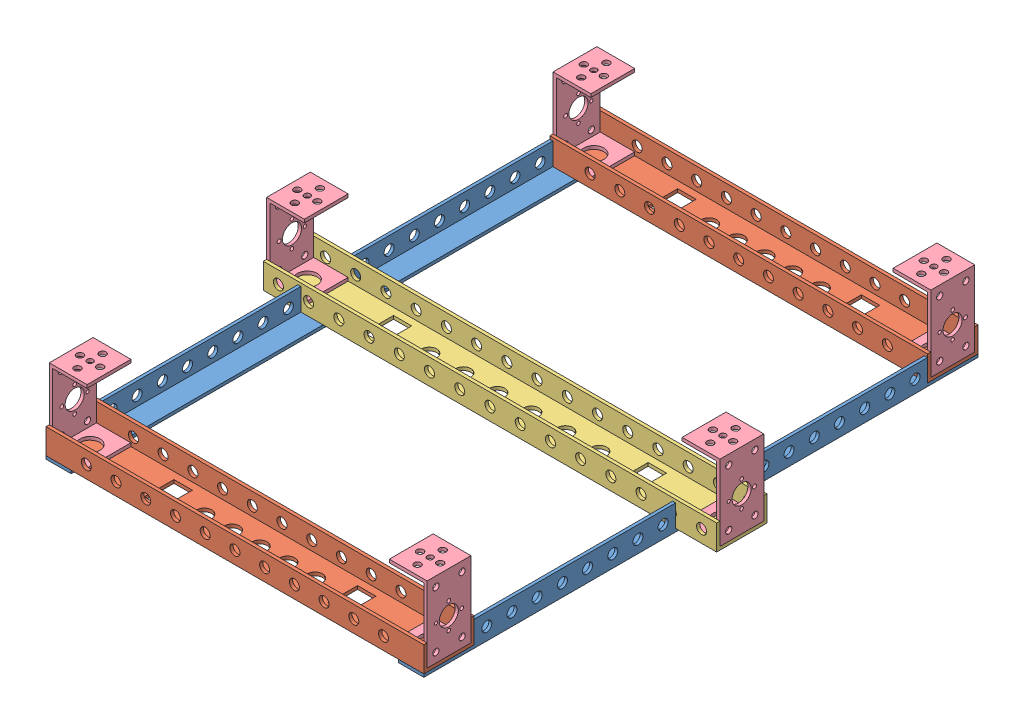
SolidWorks assembly Assem1.sldasm, configuration Default (file format 7000). Lengths in mm.
Overall size (457.2 82.55 558.8).
11 component instances, 4 part files, 29 mates.
Components (placement in the parent):
- Runners(inches)-1: Runners(inches).SLDPRT [Default] at (164.3139 303.861 189.2738) size (25.4 25.4 558.8)
- Cross Members(Front+Back)-1: Cross Members(Front+Back).SLDPRT [Default] at (502.1432 300.3197 720.2046) x (0 0 1) z (-1 0 0) size (50.8 25.4 381)
- Cross Members(Front+Back)-2: Cross Members(Front+Back).SLDPRT [Default] at (121.1432 300.3197 217.143) x (0 0 -1) z (1 0 0) size (50.8 25.4 381)
- Runners(inches)-2: Runners(inches).SLDPRT [Default] at (458.9725 303.861 748.0738) x (-1 0 0) z (0 0 -1) size (25.4 25.4 558.8)
- Cross Members(Middle)-1: Cross Members(Middle).SLDPRT [Default] at (543.4286 299.6197 466.2046) x (0 0 1) z (-1 0 0) size (50.8 25.4 457.2)
- mounting mounting-1: mounting mounting.SLDPRT [Default] at (480.68 323.6449 744.7718) x (0 -1 0) z (0 0 -1) size (76.2 38.1 44.2)
- mounting mounting-2: mounting mounting.SLDPRT [Default] at (521.9653 323.6449 490.7718) x (0 -1 0) z (0 0 -1) size (76.2 38.1 44.2)
- mounting mounting-3: mounting mounting.SLDPRT [Default] at (142.6064 323.6449 700.5758) x (0 -1 0) z (0 0 1) size (76.2 38.1 44.2)
- mounting mounting-4: mounting mounting.SLDPRT [Default] at (107.6918 323.6449 446.5758) x (0 -1 0) z (0 0 1) size (76.2 38.1 44.2)
- mounting mounting-5: mounting mounting.SLDPRT [Default] at (142.6064 323.6449 192.5758) x (0 -1 0) z (0 0 1) size (76.2 38.1 44.2)
- mounting mounting-6: mounting mounting.SLDPRT [Default] at (480.68 323.6449 236.7718) x (0 -1 0) z (0 0 -1) size (76.2 38.1 44.2)
Mates (geometry in assembly coordinates):
- Coincident1: coincident anti-aligned: plane of Runners(inches)-1 through (124.1912 281.509 748.0738) normal (0 1 0); plane of Cross Members(Front+Back)-1 through (121.1432 281.509 697.2738) normal (0 -1 0)
- Coincident2: coincident anti-aligned: plane of Runners(inches)-1 through (-434.6088 281.509 697.2738) normal (0 0 1); plane of Cross Members(Front+Back)-1 through (121.1432 281.509 697.2738) normal (0 0 -1)
- Coincident3: coincident aligned: plane of Runners(inches)-1 through (121.1432 303.861 748.0738) normal (-1 0 0); plane of Cross Members(Front+Back)-1 through (121.1432 300.3197 720.2046) normal (-1 0 0)
- Coincident4: coincident anti-aligned: plane of Runners(inches)-1 through (124.1912 281.509 748.0738) normal (0 1 0); plane of Cross Members(Front+Back)-2 through (502.1432 281.509 240.0738) normal (0 -1 0)
- Coincident5: coincident anti-aligned: plane of Runners(inches)-1 through (-434.6088 281.509 240.0738) normal (0 0 -1); plane of Cross Members(Front+Back)-2 through (502.1432 281.509 240.0738) normal (0 0 1)
- Coincident6: coincident aligned: plane of Runners(inches)-1 through (121.1432 303.861 748.0738) normal (-1 0 0); plane of Cross Members(Front+Back)-2 through (121.1432 300.3197 217.143) normal (-1 0 0)
- Coincident8: coincident: plane of Cross Members(Front+Back)-1 through (121.1432 281.509 697.2738) normal (0 -1 0); plane of Runners(inches)-2 through (499.0952 281.509 189.2738) normal (0 1 0)
- Coincident9: coincident: plane of Cross Members(Front+Back)-1 through (121.1432 281.509 697.2738) normal (0 0 -1); plane of Runners(inches)-2 through (1057.8952 281.509 697.2738) normal (0 0 1)
- Coincident10: coincident aligned: plane of Cross Members(Front+Back)-1 through (502.1432 300.3197 720.2046) normal (1 0 0); plane of Runners(inches)-2 through (502.1432 303.861 189.2738) normal (1 0 0)
- Coincident11: coincident: plane of Runners(inches)-2 through (499.0952 281.509 189.2738) normal (0 1 0); plane of Cross Members(Middle)-1 through (86.2286 281.509 443.2738) normal (0 -1 0)
- Coincident12: coincident anti-aligned: plane of Runners(inches)-2 through (1057.8952 303.861 443.2738) normal (0 0 1); plane of Cross Members(Middle)-1 through (86.2286 281.509 443.2738) normal (0 0 -1)
- Coincident13: coincident: plane of Cross Members(Front+Back)-2 through (502.1432 284.811 236.7718) normal (0 1 0); plane of mounting mounting-5 through (121.1432 284.811 236.7718) normal (0 -1 0)
- Coincident14: coincident: plane of Cross Members(Front+Back)-2 through (502.1432 306.909 236.7718) normal (0 0 -1); plane of mounting mounting-5 through (142.6064 323.6449 236.7718) normal (0 0 1)
- Coincident15: coincident aligned: plane of Cross Members(Front+Back)-2 through (121.1432 300.3197 217.143) normal (-1 0 0); plane of mounting mounting-5 through (121.1432 361.011 236.7718) normal (-1 0 0)
- Coincident16: coincident: plane of Cross Members(Front+Back)-2 through (502.1432 284.811 236.7718) normal (0 1 0); plane of mounting mounting-6 through (502.1432 284.811 192.5758) normal (0 -1 0)
- Coincident17: coincident: plane of Cross Members(Front+Back)-2 through (502.1432 306.909 192.5758) normal (0 0 1); plane of mounting mounting-6 through (480.68 323.6449 192.5758) normal (0 0 -1)
- Coincident18: coincident aligned: plane of Cross Members(Front+Back)-2 through (502.1432 300.3197 217.143) normal (1 0 0); plane of mounting mounting-6 through (502.1432 361.011 192.5758) normal (1 0 0)
- Coincident19: coincident: plane of Cross Members(Middle)-1 through (86.2286 284.811 490.7718) normal (0 1 0); plane of mounting mounting-2 through (543.4286 284.811 446.5758) normal (0 -1 0)
- Coincident20: coincident: plane of Cross Members(Middle)-1 through (86.2286 306.909 446.5758) normal (0 0 1); plane of mounting mounting-2 through (521.9653 323.6449 446.5758) normal (0 0 -1)
- Coincident21: coincident aligned: plane of Cross Members(Middle)-1 through (543.4286 299.6197 466.2046) normal (1 0 0); plane of mounting mounting-2 through (543.4286 361.011 446.5758) normal (1 0 0)
- Coincident22: coincident: plane of Cross Members(Front+Back)-1 through (121.1432 284.811 700.5758) normal (0 1 0); plane of mounting mounting-1 through (502.1432 284.811 700.5758) normal (0 -1 0)
- Coincident23: coincident: plane of Cross Members(Front+Back)-1 through (121.1432 306.909 700.5758) normal (0 0 1); plane of mounting mounting-1 through (480.68 323.6449 700.5758) normal (0 0 -1)
- Coincident24: coincident aligned: plane of Cross Members(Front+Back)-1 through (502.1432 300.3197 720.2046) normal (1 0 0); plane of mounting mounting-1 through (502.1432 361.011 700.5758) normal (1 0 0)
- Coincident25: coincident: plane of Cross Members(Front+Back)-1 through (121.1432 284.811 700.5758) normal (0 1 0); plane of mounting mounting-3 through (121.1432 284.811 744.7718) normal (0 -1 0)
- Coincident26: coincident: plane of Cross Members(Front+Back)-1 through (121.1432 306.909 744.7718) normal (0 0 -1); plane of mounting mounting-3 through (142.6064 323.6449 744.7718) normal (0 0 1)
- Coincident27: coincident aligned: plane of Cross Members(Front+Back)-1 through (121.1432 300.3197 720.2046) normal (-1 0 0); plane of mounting mounting-3 through (121.1432 361.011 744.7718) normal (-1 0 0)
- Coincident28: coincident: plane of Cross Members(Middle)-1 through (86.2286 284.811 490.7718) normal (0 1 0); plane of mounting mounting-4 through (86.2286 284.811 490.7718) normal (0 -1 0)
- Coincident29: coincident: plane of Cross Members(Middle)-1 through (86.2286 306.909 490.7718) normal (0 0 -1); plane of mounting mounting-4 through (107.6918 323.6449 490.7718) normal (0 0 1)
- Coincident30: coincident aligned: plane of Cross Members(Middle)-1 through (86.2286 299.6197 466.2046) normal (-1 0 0); plane of mounting mounting-4 through (86.2286 361.011 490.7718) normal (-1 0 0)
